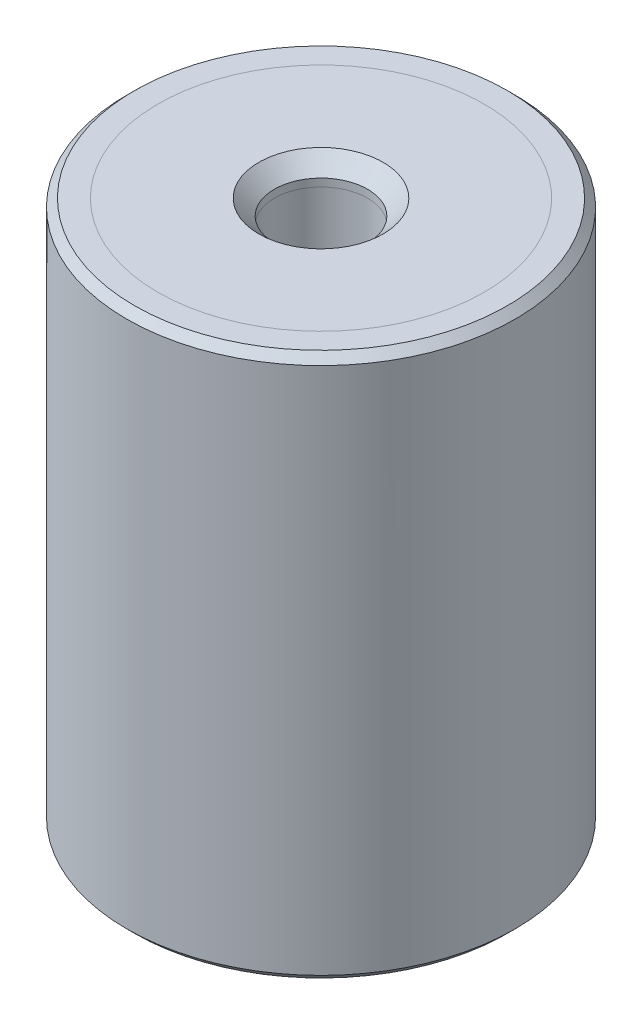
ISO-10303-21;
HEADER;
FILE_DESCRIPTION(('STEP AP214'),'2;1');
FILE_NAME('part.step','',(''),(''),'','','');
FILE_SCHEMA(('AUTOMOTIVE_DESIGN { 1 0 10303 214 1 1 1 1 }'));
ENDSEC;
DATA;
#1=APPLICATION_CONTEXT('core data for automotive mechanical design processes');
#2=APPLICATION_PROTOCOL_DEFINITION('international standard','automotive_design',2000,#1);
#3=PRODUCT_CONTEXT('',#1,'mechanical');
#4=PRODUCT('Part','Part','',(#3));
#5=PRODUCT_RELATED_PRODUCT_CATEGORY('part','',(#4));
#6=PRODUCT_DEFINITION_FORMATION('','',#4);
#7=PRODUCT_DEFINITION_CONTEXT('part definition',#1,'design');
#8=PRODUCT_DEFINITION('design','',#6,#7);
#9=PRODUCT_DEFINITION_SHAPE('','',#8);
#10=(LENGTH_UNIT() NAMED_UNIT(*) SI_UNIT(.MILLI.,.METRE.));
#11=(NAMED_UNIT(*) PLANE_ANGLE_UNIT() SI_UNIT($,.RADIAN.));
#12=(NAMED_UNIT(*) SI_UNIT($,.STERADIAN.) SOLID_ANGLE_UNIT());
#13=UNCERTAINTY_MEASURE_WITH_UNIT(LENGTH_MEASURE(1.E-05),#10,'distance_accuracy_value','');
#14=(GEOMETRIC_REPRESENTATION_CONTEXT(3) GLOBAL_UNCERTAINTY_ASSIGNED_CONTEXT((#13)) GLOBAL_UNIT_ASSIGNED_CONTEXT((#10,
#11,#12)) REPRESENTATION_CONTEXT('',''));
#15=CARTESIAN_POINT('',(0.,0.,0.));
#16=DIRECTION('',(0.,0.,1.));
#17=DIRECTION('',(1.,0.,0.));
#18=AXIS2_PLACEMENT_3D('',#15,#16,#17);
#19=CARTESIAN_POINT('',(0.,36.0340428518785,0.));
#20=DIRECTION('',(0.,1.,0.));
#21=DIRECTION('',(0.,0.,1.));
#22=AXIS2_PLACEMENT_3D('',#19,#20,#21);
#23=CYLINDRICAL_SURFACE('',#22,3.);
#24=CARTESIAN_POINT('',(0.,-32.5,0.));
#25=DIRECTION('',(0.,-1.,0.));
#26=DIRECTION('',(0.,0.,-1.));
#27=AXIS2_PLACEMENT_3D('',#24,#25,#26);
#28=CIRCLE('',#27,3.);
#29=CARTESIAN_POINT('',(0.,-32.5,-3.));
#30=VERTEX_POINT('',#29);
#31=EDGE_CURVE('P0_E10',#30,#30,#28,.T.);
#32=ORIENTED_EDGE('',*,*,#31,.T.);
#33=EDGE_LOOP('',(#32));
#34=FACE_BOUND('',#33,.T.);
#35=CARTESIAN_POINT('',(0.,-32.,0.));
#36=DIRECTION('',(0.,1.,0.));
#37=DIRECTION('',(0.,0.,1.));
#38=AXIS2_PLACEMENT_3D('',#35,#36,#37);
#39=CIRCLE('',#38,3.);
#40=CARTESIAN_POINT('',(0.,-32.,3.));
#41=VERTEX_POINT('',#40);
#42=EDGE_CURVE('P0_E25',#41,#41,#39,.T.);
#43=ORIENTED_EDGE('',*,*,#42,.T.);
#44=EDGE_LOOP('',(#43));
#45=FACE_BOUND('',#44,.T.);
#46=ADVANCED_FACE('P0_F14',(#34,#45),#23,.F.);
#47=CARTESIAN_POINT('',(0.,-32.,3.));
#48=DIRECTION('',(0.,1.,0.));
#49=DIRECTION('',(0.,0.,1.));
#50=AXIS2_PLACEMENT_3D('',#47,#48,#49);
#51=PLANE('',#50);
#52=CARTESIAN_POINT('',(0.,-32.,0.));
#53=DIRECTION('',(0.,1.,0.));
#54=DIRECTION('',(0.,0.,1.));
#55=AXIS2_PLACEMENT_3D('',#52,#53,#54);
#56=CIRCLE('',#55,10.5);
#57=CARTESIAN_POINT('',(0.,-32.,10.5));
#58=VERTEX_POINT('',#57);
#59=EDGE_CURVE('P0_E29',#58,#58,#56,.T.);
#60=ORIENTED_EDGE('',*,*,#59,.T.);
#61=EDGE_LOOP('',(#60));
#62=FACE_BOUND('',#61,.T.);
#63=ORIENTED_EDGE('',*,*,#42,.F.);
#64=EDGE_LOOP('',(#63));
#65=FACE_BOUND('',#64,.T.);
#66=ADVANCED_FACE('P0_F50',(#62,#65),#51,.T.);
#67=CARTESIAN_POINT('',(0.,36.0340428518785,0.));
#68=DIRECTION('',(0.,1.,0.));
#69=DIRECTION('',(0.,0.,1.));
#70=AXIS2_PLACEMENT_3D('',#67,#68,#69);
#71=CYLINDRICAL_SURFACE('',#70,10.5);
#72=CARTESIAN_POINT('',(0.,-33.5,0.));
#73=DIRECTION('',(0.,1.,0.));
#74=DIRECTION('',(0.,0.,1.));
#75=AXIS2_PLACEMENT_3D('',#72,#73,#74);
#76=CIRCLE('',#75,10.5);
#77=CARTESIAN_POINT('',(0.,-33.5,10.5));
#78=VERTEX_POINT('',#77);
#79=EDGE_CURVE('P0_E34',#78,#78,#76,.T.);
#80=ORIENTED_EDGE('',*,*,#79,.T.);
#81=EDGE_LOOP('',(#80));
#82=FACE_BOUND('',#81,.T.);
#83=ORIENTED_EDGE('',*,*,#59,.F.);
#84=EDGE_LOOP('',(#83));
#85=FACE_BOUND('',#84,.T.);
#86=ADVANCED_FACE('P0_F38',(#82,#85),#71,.T.);
#87=CARTESIAN_POINT('',(0.,-33.5,10.5));
#88=DIRECTION('',(0.,-1.,0.));
#89=DIRECTION('',(0.,0.,-1.));
#90=AXIS2_PLACEMENT_3D('',#87,#88,#89);
#91=PLANE('',#90);
#92=CARTESIAN_POINT('',(0.,-33.5,0.));
#93=DIRECTION('',(0.,-1.,0.));
#94=DIRECTION('',(0.,0.,-1.));
#95=AXIS2_PLACEMENT_3D('',#92,#93,#94);
#96=CIRCLE('',#95,4.);
#97=CARTESIAN_POINT('',(0.,-33.5,-4.));
#98=VERTEX_POINT('',#97);
#99=EDGE_CURVE('P0_E21',#98,#98,#96,.F.);
#100=ORIENTED_EDGE('',*,*,#99,.T.);
#101=EDGE_LOOP('',(#100));
#102=FACE_BOUND('',#101,.T.);
#103=ORIENTED_EDGE('',*,*,#79,.F.);
#104=EDGE_LOOP('',(#103));
#105=FACE_BOUND('',#104,.T.);
#106=ADVANCED_FACE('P0_F41',(#102,#105),#91,.T.);
#107=CARTESIAN_POINT('',(0.,-33.5,0.));
#108=DIRECTION('',(0.,-1.,0.));
#109=DIRECTION('',(0.,0.,-1.));
#110=AXIS2_PLACEMENT_3D('',#107,#108,#109);
#111=CONICAL_SURFACE('',#110,4.,0.785398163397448);
#112=ORIENTED_EDGE('',*,*,#31,.F.);
#113=EDGE_LOOP('',(#112));
#114=FACE_BOUND('',#113,.T.);
#115=ORIENTED_EDGE('',*,*,#99,.F.);
#116=EDGE_LOOP('',(#115));
#117=FACE_BOUND('',#116,.T.);
#118=ADVANCED_FACE('P0_F16',(#114,#117),#111,.F.);
#119=CLOSED_SHELL('',(#46,#66,#86,#106,#118));
#120=MANIFOLD_SOLID_BREP('P0_B1',#119);
#121=CARTESIAN_POINT('',(0.,69.5340428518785,0.));
#122=DIRECTION('',(0.,1.,0.));
#123=DIRECTION('',(0.,0.,1.));
#124=AXIS2_PLACEMENT_3D('',#121,#122,#123);
#125=CYLINDRICAL_SURFACE('',#124,3.);
#126=CARTESIAN_POINT('',(0.,0.5,0.));
#127=DIRECTION('',(0.,1.,0.));
#128=DIRECTION('',(0.,0.,1.));
#129=AXIS2_PLACEMENT_3D('',#126,#127,#128);
#130=CIRCLE('',#129,3.);
#131=CARTESIAN_POINT('',(0.,0.5,3.));
#132=VERTEX_POINT('',#131);
#133=EDGE_CURVE('P1_E21',#132,#132,#130,.T.);
#134=ORIENTED_EDGE('',*,*,#133,.T.);
#135=EDGE_LOOP('',(#134));
#136=FACE_BOUND('',#135,.T.);
#137=CARTESIAN_POINT('',(0.,0.,0.));
#138=DIRECTION('',(0.,1.,0.));
#139=DIRECTION('',(0.,0.,1.));
#140=AXIS2_PLACEMENT_3D('',#137,#138,#139);
#141=CIRCLE('',#140,3.);
#142=CARTESIAN_POINT('',(0.,0.,3.));
#143=VERTEX_POINT('',#142);
#144=EDGE_CURVE('P1_E34',#143,#143,#141,.T.);
#145=ORIENTED_EDGE('',*,*,#144,.F.);
#146=EDGE_LOOP('',(#145));
#147=FACE_BOUND('',#146,.T.);
#148=ADVANCED_FACE('P1_F14',(#136,#147),#125,.F.);
#149=CARTESIAN_POINT('',(0.,1.5,3.));
#150=DIRECTION('',(0.,1.,0.));
#151=DIRECTION('',(0.,0.,1.));
#152=AXIS2_PLACEMENT_3D('',#149,#150,#151);
#153=PLANE('',#152);
#154=CARTESIAN_POINT('',(0.,1.5,0.));
#155=DIRECTION('',(0.,1.,0.));
#156=DIRECTION('',(0.,0.,1.));
#157=AXIS2_PLACEMENT_3D('',#154,#155,#156);
#158=CIRCLE('',#157,4.);
#159=CARTESIAN_POINT('',(0.,1.5,4.));
#160=VERTEX_POINT('',#159);
#161=EDGE_CURVE('P1_E10',#160,#160,#158,.F.);
#162=ORIENTED_EDGE('',*,*,#161,.T.);
#163=EDGE_LOOP('',(#162));
#164=FACE_BOUND('',#163,.T.);
#165=CARTESIAN_POINT('',(0.,1.5,0.));
#166=DIRECTION('',(0.,1.,0.));
#167=DIRECTION('',(0.,0.,1.));
#168=AXIS2_PLACEMENT_3D('',#165,#166,#167);
#169=CIRCLE('',#168,10.5);
#170=CARTESIAN_POINT('',(0.,1.5,10.5));
#171=VERTEX_POINT('',#170);
#172=EDGE_CURVE('P1_E25',#171,#171,#169,.T.);
#173=ORIENTED_EDGE('',*,*,#172,.T.);
#174=EDGE_LOOP('',(#173));
#175=FACE_BOUND('',#174,.T.);
#176=ADVANCED_FACE('P1_F42',(#164,#175),#153,.T.);
#177=CARTESIAN_POINT('',(0.,69.5340428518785,0.));
#178=DIRECTION('',(0.,1.,0.));
#179=DIRECTION('',(0.,0.,1.));
#180=AXIS2_PLACEMENT_3D('',#177,#178,#179);
#181=CYLINDRICAL_SURFACE('',#180,10.5);
#182=CARTESIAN_POINT('',(0.,0.,0.));
#183=DIRECTION('',(0.,1.,0.));
#184=DIRECTION('',(0.,0.,1.));
#185=AXIS2_PLACEMENT_3D('',#182,#183,#184);
#186=CIRCLE('',#185,10.5);
#187=CARTESIAN_POINT('',(0.,0.,10.5));
#188=VERTEX_POINT('',#187);
#189=EDGE_CURVE('P1_E29',#188,#188,#186,.T.);
#190=ORIENTED_EDGE('',*,*,#189,.T.);
#191=EDGE_LOOP('',(#190));
#192=FACE_BOUND('',#191,.T.);
#193=ORIENTED_EDGE('',*,*,#172,.F.);
#194=EDGE_LOOP('',(#193));
#195=FACE_BOUND('',#194,.T.);
#196=ADVANCED_FACE('P1_F47',(#192,#195),#181,.T.);
#197=CARTESIAN_POINT('',(0.,0.,10.5));
#198=DIRECTION('',(0.,-1.,0.));
#199=DIRECTION('',(0.,0.,-1.));
#200=AXIS2_PLACEMENT_3D('',#197,#198,#199);
#201=PLANE('',#200);
#202=ORIENTED_EDGE('',*,*,#144,.T.);
#203=EDGE_LOOP('',(#202));
#204=FACE_BOUND('',#203,.T.);
#205=ORIENTED_EDGE('',*,*,#189,.F.);
#206=EDGE_LOOP('',(#205));
#207=FACE_BOUND('',#206,.T.);
#208=ADVANCED_FACE('P1_F38',(#204,#207),#201,.T.);
#209=CARTESIAN_POINT('',(0.,0.5,0.));
#210=DIRECTION('',(0.,1.,0.));
#211=DIRECTION('',(0.,0.,1.));
#212=AXIS2_PLACEMENT_3D('',#209,#210,#211);
#213=CONICAL_SURFACE('',#212,3.,0.78539816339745);
#214=ORIENTED_EDGE('',*,*,#161,.F.);
#215=EDGE_LOOP('',(#214));
#216=FACE_BOUND('',#215,.T.);
#217=ORIENTED_EDGE('',*,*,#133,.F.);
#218=EDGE_LOOP('',(#217));
#219=FACE_BOUND('',#218,.T.);
#220=ADVANCED_FACE('P1_F16',(#216,#219),#213,.F.);
#221=CLOSED_SHELL('',(#148,#176,#196,#208,#220));
#222=MANIFOLD_SOLID_BREP('P1_B1',#221);
#223=CARTESIAN_POINT('',(0.,0.,0.));
#224=DIRECTION('',(0.,1.,0.));
#225=DIRECTION('',(0.,0.,1.));
#226=AXIS2_PLACEMENT_3D('',#223,#224,#225);
#227=PLANE('',#226);
#228=CARTESIAN_POINT('',(0.,0.,0.));
#229=DIRECTION('',(0.,1.,0.));
#230=DIRECTION('',(0.,0.,1.));
#231=AXIS2_PLACEMENT_3D('',#228,#229,#230);
#232=CIRCLE('',#231,3.);
#233=CARTESIAN_POINT('',(0.,0.,3.));
#234=VERTEX_POINT('',#233);
#235=EDGE_CURVE('P2_E46',#234,#234,#232,.T.);
#236=ORIENTED_EDGE('',*,*,#235,.F.);
#237=EDGE_LOOP('',(#236));
#238=FACE_BOUND('',#237,.T.);
#239=CARTESIAN_POINT('',(0.,0.,0.));
#240=DIRECTION('',(0.,1.,0.));
#241=DIRECTION('',(0.,0.,1.));
#242=AXIS2_PLACEMENT_3D('',#239,#240,#241);
#243=CIRCLE('',#242,10.5);
#244=CARTESIAN_POINT('',(0.,0.,10.5));
#245=VERTEX_POINT('',#244);
#246=EDGE_CURVE('P2_E33',#245,#245,#243,.T.);
#247=ORIENTED_EDGE('',*,*,#246,.T.);
#248=EDGE_LOOP('',(#247));
#249=FACE_BOUND('',#248,.T.);
#250=ADVANCED_FACE('P2_F13',(#238,#249),#227,.T.);
#251=CARTESIAN_POINT('',(0.,65.5134936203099,0.));
#252=DIRECTION('',(0.,1.,0.));
#253=DIRECTION('',(0.,0.,1.));
#254=AXIS2_PLACEMENT_3D('',#251,#252,#253);
#255=CYLINDRICAL_SURFACE('',#254,10.5);
#256=CARTESIAN_POINT('',(0.,1.5,0.));
#257=DIRECTION('',(0.,1.,0.));
#258=DIRECTION('',(0.,0.,1.));
#259=AXIS2_PLACEMENT_3D('',#256,#257,#258);
#260=CIRCLE('',#259,10.5);
#261=CARTESIAN_POINT('',(0.,1.5,10.5));
#262=VERTEX_POINT('',#261);
#263=EDGE_CURVE('P2_E36',#262,#262,#260,.T.);
#264=ORIENTED_EDGE('',*,*,#263,.T.);
#265=EDGE_LOOP('',(#264));
#266=FACE_BOUND('',#265,.T.);
#267=ORIENTED_EDGE('',*,*,#246,.F.);
#268=EDGE_LOOP('',(#267));
#269=FACE_BOUND('',#268,.T.);
#270=ADVANCED_FACE('P2_F92',(#266,#269),#255,.F.);
#271=CARTESIAN_POINT('',(0.,1.5,10.5));
#272=DIRECTION('',(0.,1.,0.));
#273=DIRECTION('',(0.,0.,1.));
#274=AXIS2_PLACEMENT_3D('',#271,#272,#273);
#275=PLANE('',#274);
#276=CARTESIAN_POINT('',(0.,1.5,0.));
#277=DIRECTION('',(0.,1.,0.));
#278=DIRECTION('',(0.,0.,1.));
#279=AXIS2_PLACEMENT_3D('',#276,#277,#278);
#280=CIRCLE('',#279,12.);
#281=CARTESIAN_POINT('',(0.,1.5,12.));
#282=VERTEX_POINT('',#281);
#283=EDGE_CURVE('P2_E9',#282,#282,#280,.T.);
#284=ORIENTED_EDGE('',*,*,#283,.T.);
#285=EDGE_LOOP('',(#284));
#286=FACE_BOUND('',#285,.T.);
#287=ORIENTED_EDGE('',*,*,#263,.F.);
#288=EDGE_LOOP('',(#287));
#289=FACE_BOUND('',#288,.T.);
#290=ADVANCED_FACE('P2_F88',(#286,#289),#275,.T.);
#291=CARTESIAN_POINT('',(0.,65.5134936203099,0.));
#292=DIRECTION('',(0.,1.,0.));
#293=DIRECTION('',(0.,0.,1.));
#294=AXIS2_PLACEMENT_3D('',#291,#292,#293);
#295=CYLINDRICAL_SURFACE('',#294,12.5);
#296=CARTESIAN_POINT('',(0.,-33.,0.));
#297=DIRECTION('',(0.,-1.,0.));
#298=DIRECTION('',(0.,0.,-1.));
#299=AXIS2_PLACEMENT_3D('',#296,#297,#298);
#300=CIRCLE('',#299,12.5);
#301=CARTESIAN_POINT('',(0.,-33.,-12.5));
#302=VERTEX_POINT('',#301);
#303=EDGE_CURVE('P2_E24',#302,#302,#300,.F.);
#304=ORIENTED_EDGE('',*,*,#303,.T.);
#305=EDGE_LOOP('',(#304));
#306=FACE_BOUND('',#305,.T.);
#307=CARTESIAN_POINT('',(0.,0.999999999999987,0.));
#308=DIRECTION('',(0.,1.,0.));
#309=DIRECTION('',(0.,0.,1.));
#310=AXIS2_PLACEMENT_3D('',#307,#308,#309);
#311=CIRCLE('',#310,12.5);
#312=CARTESIAN_POINT('',(0.,0.999999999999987,12.5));
#313=VERTEX_POINT('',#312);
#314=EDGE_CURVE('P2_E28',#313,#313,#311,.F.);
#315=ORIENTED_EDGE('',*,*,#314,.T.);
#316=EDGE_LOOP('',(#315));
#317=FACE_BOUND('',#316,.T.);
#318=ADVANCED_FACE('P2_F82',(#306,#317),#295,.T.);
#319=CARTESIAN_POINT('',(0.,-33.5,12.5));
#320=DIRECTION('',(0.,-1.,0.));
#321=DIRECTION('',(0.,0.,-1.));
#322=AXIS2_PLACEMENT_3D('',#319,#320,#321);
#323=PLANE('',#322);
#324=CARTESIAN_POINT('',(0.,-33.5,0.));
#325=DIRECTION('',(0.,-1.,0.));
#326=DIRECTION('',(0.,0.,-1.));
#327=AXIS2_PLACEMENT_3D('',#324,#325,#326);
#328=CIRCLE('',#327,12.);
#329=CARTESIAN_POINT('',(0.,-33.5,-12.));
#330=VERTEX_POINT('',#329);
#331=EDGE_CURVE('P2_E20',#330,#330,#328,.T.);
#332=ORIENTED_EDGE('',*,*,#331,.T.);
#333=EDGE_LOOP('',(#332));
#334=FACE_BOUND('',#333,.T.);
#335=CARTESIAN_POINT('',(0.,-33.5,0.));
#336=DIRECTION('',(0.,1.,0.));
#337=DIRECTION('',(0.,0.,1.));
#338=AXIS2_PLACEMENT_3D('',#335,#336,#337);
#339=CIRCLE('',#338,10.5);
#340=CARTESIAN_POINT('',(0.,-33.5,10.5));
#341=VERTEX_POINT('',#340);
#342=EDGE_CURVE('P2_E39',#341,#341,#339,.T.);
#343=ORIENTED_EDGE('',*,*,#342,.T.);
#344=EDGE_LOOP('',(#343));
#345=FACE_BOUND('',#344,.T.);
#346=ADVANCED_FACE('P2_F77',(#334,#345),#323,.T.);
#347=CARTESIAN_POINT('',(0.,65.5134936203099,0.));
#348=DIRECTION('',(0.,1.,0.));
#349=DIRECTION('',(0.,0.,1.));
#350=AXIS2_PLACEMENT_3D('',#347,#348,#349);
#351=CYLINDRICAL_SURFACE('',#350,10.5);
#352=CARTESIAN_POINT('',(0.,-32.,0.));
#353=DIRECTION('',(0.,1.,0.));
#354=DIRECTION('',(0.,0.,1.));
#355=AXIS2_PLACEMENT_3D('',#352,#353,#354);
#356=CIRCLE('',#355,10.5);
#357=CARTESIAN_POINT('',(0.,-32.,10.5));
#358=VERTEX_POINT('',#357);
#359=EDGE_CURVE('P2_E42',#358,#358,#356,.T.);
#360=ORIENTED_EDGE('',*,*,#359,.T.);
#361=EDGE_LOOP('',(#360));
#362=FACE_BOUND('',#361,.T.);
#363=ORIENTED_EDGE('',*,*,#342,.F.);
#364=EDGE_LOOP('',(#363));
#365=FACE_BOUND('',#364,.T.);
#366=ADVANCED_FACE('P2_F71',(#362,#365),#351,.F.);
#367=CARTESIAN_POINT('',(0.,-32.,10.5));
#368=DIRECTION('',(0.,-1.,0.));
#369=DIRECTION('',(0.,0.,-1.));
#370=AXIS2_PLACEMENT_3D('',#367,#368,#369);
#371=PLANE('',#370);
#372=CARTESIAN_POINT('',(0.,-32.,0.));
#373=DIRECTION('',(0.,-1.,0.));
#374=DIRECTION('',(0.,0.,-1.));
#375=AXIS2_PLACEMENT_3D('',#372,#373,#374);
#376=CIRCLE('',#375,3.);
#377=CARTESIAN_POINT('',(0.,-32.,-3.));
#378=VERTEX_POINT('',#377);
#379=EDGE_CURVE('P2_E52',#378,#378,#376,.T.);
#380=ORIENTED_EDGE('',*,*,#379,.F.);
#381=EDGE_LOOP('',(#380));
#382=FACE_BOUND('',#381,.T.);
#383=ORIENTED_EDGE('',*,*,#359,.F.);
#384=EDGE_LOOP('',(#383));
#385=FACE_BOUND('',#384,.T.);
#386=ADVANCED_FACE('P2_F67',(#382,#385),#371,.T.);
#387=CARTESIAN_POINT('',(0.,-33.,0.));
#388=DIRECTION('',(0.,1.,0.));
#389=DIRECTION('',(0.,0.,1.));
#390=AXIS2_PLACEMENT_3D('',#387,#388,#389);
#391=CONICAL_SURFACE('',#390,12.5,0.785398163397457);
#392=ORIENTED_EDGE('',*,*,#331,.F.);
#393=EDGE_LOOP('',(#392));
#394=FACE_BOUND('',#393,.T.);
#395=ORIENTED_EDGE('',*,*,#303,.F.);
#396=EDGE_LOOP('',(#395));
#397=FACE_BOUND('',#396,.T.);
#398=ADVANCED_FACE('P2_F70',(#394,#397),#391,.T.);
#399=CARTESIAN_POINT('',(0.,1.5,0.));
#400=DIRECTION('',(0.,-1.,0.));
#401=DIRECTION('',(0.,0.,-1.));
#402=AXIS2_PLACEMENT_3D('',#399,#400,#401);
#403=CONICAL_SURFACE('',#402,12.,0.785398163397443);
#404=ORIENTED_EDGE('',*,*,#314,.F.);
#405=EDGE_LOOP('',(#404));
#406=FACE_BOUND('',#405,.T.);
#407=ORIENTED_EDGE('',*,*,#283,.F.);
#408=EDGE_LOOP('',(#407));
#409=FACE_BOUND('',#408,.T.);
#410=ADVANCED_FACE('P2_F15',(#406,#409),#403,.T.);
#411=CARTESIAN_POINT('',(0.,-4.5,0.));
#412=DIRECTION('',(0.,1.,0.));
#413=DIRECTION('',(0.,0.,1.));
#414=AXIS2_PLACEMENT_3D('',#411,#412,#413);
#415=CYLINDRICAL_SURFACE('',#414,3.);
#416=CARTESIAN_POINT('',(0.,-4.5,0.));
#417=DIRECTION('',(0.,1.,0.));
#418=DIRECTION('',(0.,0.,1.));
#419=AXIS2_PLACEMENT_3D('',#416,#417,#418);
#420=CIRCLE('',#419,3.);
#421=CARTESIAN_POINT('',(0.,-4.5,3.));
#422=VERTEX_POINT('',#421);
#423=EDGE_CURVE('P2_E45',#422,#422,#420,.T.);
#424=ORIENTED_EDGE('',*,*,#423,.F.);
#425=EDGE_LOOP('',(#424));
#426=FACE_BOUND('',#425,.T.);
#427=ORIENTED_EDGE('',*,*,#235,.T.);
#428=EDGE_LOOP('',(#427));
#429=FACE_BOUND('',#428,.T.);
#430=ADVANCED_FACE('P2_F108',(#426,#429),#415,.F.);
#431=CARTESIAN_POINT('',(0.,-4.5,0.));
#432=DIRECTION('',(0.,1.,0.));
#433=DIRECTION('',(0.,0.,1.));
#434=AXIS2_PLACEMENT_3D('',#431,#432,#433);
#435=PLANE('',#434);
#436=ORIENTED_EDGE('',*,*,#423,.T.);
#437=EDGE_LOOP('',(#436));
#438=FACE_BOUND('',#437,.T.);
#439=ADVANCED_FACE('P2_F63',(#438),#435,.T.);
#440=CARTESIAN_POINT('',(0.,-27.5,0.));
#441=DIRECTION('',(0.,-1.,0.));
#442=DIRECTION('',(0.,0.,-1.));
#443=AXIS2_PLACEMENT_3D('',#440,#441,#442);
#444=CYLINDRICAL_SURFACE('',#443,3.);
#445=CARTESIAN_POINT('',(0.,-27.5,0.));
#446=DIRECTION('',(0.,-1.,0.));
#447=DIRECTION('',(0.,0.,-1.));
#448=AXIS2_PLACEMENT_3D('',#445,#446,#447);
#449=CIRCLE('',#448,3.);
#450=CARTESIAN_POINT('',(0.,-27.5,-3.));
#451=VERTEX_POINT('',#450);
#452=EDGE_CURVE('P2_E49',#451,#451,#449,.T.);
#453=ORIENTED_EDGE('',*,*,#452,.F.);
#454=EDGE_LOOP('',(#453));
#455=FACE_BOUND('',#454,.T.);
#456=ORIENTED_EDGE('',*,*,#379,.T.);
#457=EDGE_LOOP('',(#456));
#458=FACE_BOUND('',#457,.T.);
#459=ADVANCED_FACE('P2_F60',(#455,#458),#444,.F.);
#460=CARTESIAN_POINT('',(0.,-27.5,0.));
#461=DIRECTION('',(0.,-1.,0.));
#462=DIRECTION('',(0.,0.,-1.));
#463=AXIS2_PLACEMENT_3D('',#460,#461,#462);
#464=PLANE('',#463);
#465=ORIENTED_EDGE('',*,*,#452,.T.);
#466=EDGE_LOOP('',(#465));
#467=FACE_BOUND('',#466,.T.);
#468=ADVANCED_FACE('P2_F58',(#467),#464,.T.);
#469=CLOSED_SHELL('',(#250,#270,#290,#318,#346,#366,#386,#398,#410,#430,#439,#459,#468));
#470=MANIFOLD_SOLID_BREP('P2_B1',#469);
#471=ADVANCED_BREP_SHAPE_REPRESENTATION('',(#18,#120,#222,#470),#14);
#472=SHAPE_DEFINITION_REPRESENTATION(#9,#471);
ENDSEC;
END-ISO-10303-21;
